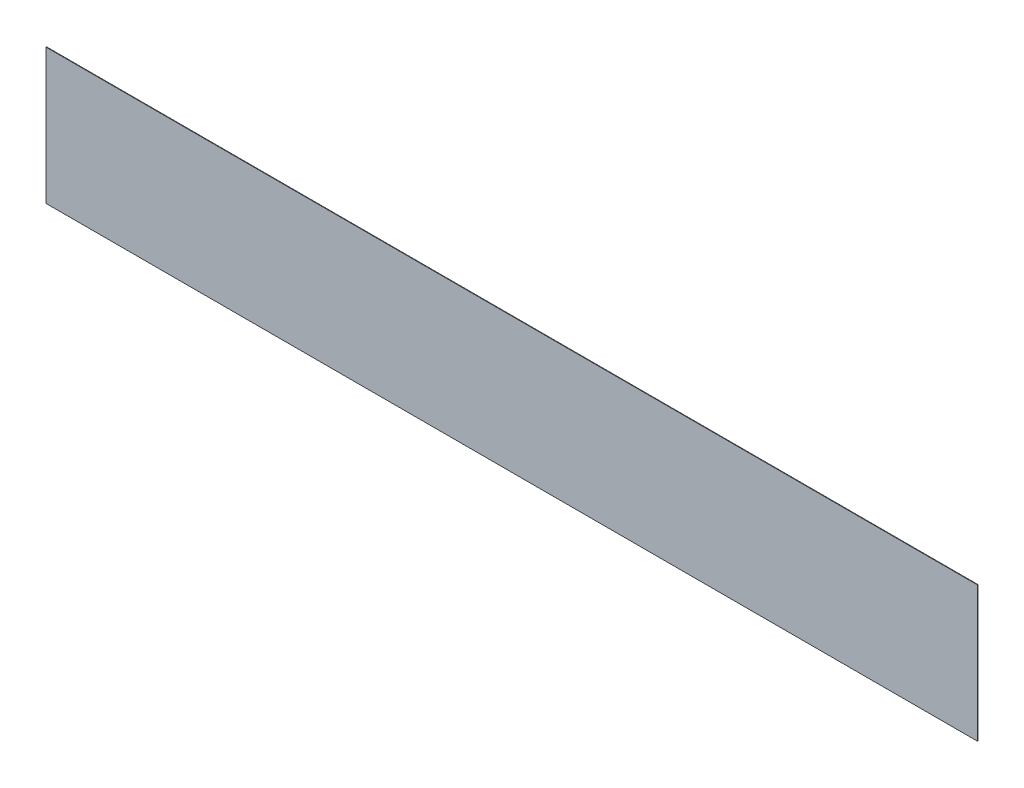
ISO-10303-21;
HEADER;
FILE_DESCRIPTION(('STEP AP214'),'2;1');
FILE_NAME('part.step','',(''),(''),'','','');
FILE_SCHEMA(('AUTOMOTIVE_DESIGN { 1 0 10303 214 1 1 1 1 }'));
ENDSEC;
DATA;
#1=APPLICATION_CONTEXT('core data for automotive mechanical design processes');
#2=APPLICATION_PROTOCOL_DEFINITION('international standard','automotive_design',2000,#1);
#3=PRODUCT_CONTEXT('',#1,'mechanical');
#4=PRODUCT('Part','Part','',(#3));
#5=PRODUCT_RELATED_PRODUCT_CATEGORY('part','',(#4));
#6=PRODUCT_DEFINITION_FORMATION('','',#4);
#7=PRODUCT_DEFINITION_CONTEXT('part definition',#1,'design');
#8=PRODUCT_DEFINITION('design','',#6,#7);
#9=PRODUCT_DEFINITION_SHAPE('','',#8);
#10=(LENGTH_UNIT() NAMED_UNIT(*) SI_UNIT(.MILLI.,.METRE.));
#11=(NAMED_UNIT(*) PLANE_ANGLE_UNIT() SI_UNIT($,.RADIAN.));
#12=(NAMED_UNIT(*) SI_UNIT($,.STERADIAN.) SOLID_ANGLE_UNIT());
#13=UNCERTAINTY_MEASURE_WITH_UNIT(LENGTH_MEASURE(1.E-05),#10,'distance_accuracy_value','');
#14=(GEOMETRIC_REPRESENTATION_CONTEXT(3) GLOBAL_UNCERTAINTY_ASSIGNED_CONTEXT((#13)) GLOBAL_UNIT_ASSIGNED_CONTEXT((#10,
#11,#12)) REPRESENTATION_CONTEXT('',''));
#15=CARTESIAN_POINT('',(0.,0.,0.));
#16=DIRECTION('',(0.,0.,1.));
#17=DIRECTION('',(1.,0.,0.));
#18=AXIS2_PLACEMENT_3D('',#15,#16,#17);
#19=CARTESIAN_POINT('',(7.,0.,0.1));
#20=DIRECTION('',(1.,0.,0.));
#21=DIRECTION('',(0.,0.,-1.));
#22=AXIS2_PLACEMENT_3D('',#19,#20,#21);
#23=PLANE('',#22);
#24=DIRECTION('',(0.,-1.,0.));
#25=VECTOR('',#24,1.);
#26=CARTESIAN_POINT('',(7.,0.,0.));
#27=LINE('',#26,#25);
#28=CARTESIAN_POINT('',(7.,25.,0.));
#29=VERTEX_POINT('',#28);
#30=CARTESIAN_POINT('',(7.,0.,0.));
#31=VERTEX_POINT('',#30);
#32=EDGE_CURVE('E98',#29,#31,#27,.T.);
#33=ORIENTED_EDGE('',*,*,#32,.T.);
#34=DIRECTION('',(0.,0.,-1.));
#35=VECTOR('',#34,1.);
#36=CARTESIAN_POINT('',(7.,0.,0.1));
#37=LINE('',#36,#35);
#38=CARTESIAN_POINT('',(7.,0.,0.1));
#39=VERTEX_POINT('',#38);
#40=EDGE_CURVE('E11',#39,#31,#37,.T.);
#41=ORIENTED_EDGE('',*,*,#40,.F.);
#42=DIRECTION('',(0.,-1.,0.));
#43=VECTOR('',#42,1.);
#44=CARTESIAN_POINT('',(7.,0.,0.1));
#45=LINE('',#44,#43);
#46=CARTESIAN_POINT('',(7.,25.,0.1));
#47=VERTEX_POINT('',#46);
#48=EDGE_CURVE('E86',#47,#39,#45,.T.);
#49=ORIENTED_EDGE('',*,*,#48,.F.);
#50=DIRECTION('',(0.,0.,-1.));
#51=VECTOR('',#50,1.);
#52=CARTESIAN_POINT('',(7.,25.,0.1));
#53=LINE('',#52,#51);
#54=EDGE_CURVE('E94',#47,#29,#53,.T.);
#55=ORIENTED_EDGE('',*,*,#54,.T.);
#56=EDGE_LOOP('',(#33,#41,#49,#55));
#57=FACE_BOUND('',#56,.T.);
#58=ADVANCED_FACE('F35',(#57),#23,.F.);
#59=CARTESIAN_POINT('',(7.,0.,0.1));
#60=DIRECTION('',(0.,1.,0.));
#61=DIRECTION('',(0.,0.,1.));
#62=AXIS2_PLACEMENT_3D('',#59,#60,#61);
#63=PLANE('',#62);
#64=DIRECTION('',(1.,0.,0.));
#65=VECTOR('',#64,1.);
#66=CARTESIAN_POINT('',(7.,0.,0.));
#67=LINE('',#66,#65);
#68=CARTESIAN_POINT('',(179.,0.,0.));
#69=VERTEX_POINT('',#68);
#70=EDGE_CURVE('E90',#31,#69,#67,.T.);
#71=ORIENTED_EDGE('',*,*,#70,.T.);
#72=DIRECTION('',(0.,0.,-1.));
#73=VECTOR('',#72,1.);
#74=CARTESIAN_POINT('',(179.,0.,0.1));
#75=LINE('',#74,#73);
#76=CARTESIAN_POINT('',(179.,0.,0.1));
#77=VERTEX_POINT('',#76);
#78=EDGE_CURVE('E43',#77,#69,#75,.T.);
#79=ORIENTED_EDGE('',*,*,#78,.F.);
#80=DIRECTION('',(1.,0.,0.));
#81=VECTOR('',#80,1.);
#82=CARTESIAN_POINT('',(7.,0.,0.1));
#83=LINE('',#82,#81);
#84=EDGE_CURVE('E81',#39,#77,#83,.T.);
#85=ORIENTED_EDGE('',*,*,#84,.F.);
#86=ORIENTED_EDGE('',*,*,#40,.T.);
#87=EDGE_LOOP('',(#71,#79,#85,#86));
#88=FACE_BOUND('',#87,.T.);
#89=ADVANCED_FACE('F89',(#88),#63,.F.);
#90=CARTESIAN_POINT('',(179.,0.,0.1));
#91=DIRECTION('',(-1.,0.,0.));
#92=DIRECTION('',(0.,0.,1.));
#93=AXIS2_PLACEMENT_3D('',#90,#91,#92);
#94=PLANE('',#93);
#95=DIRECTION('',(0.,1.,0.));
#96=VECTOR('',#95,1.);
#97=CARTESIAN_POINT('',(179.,0.,0.));
#98=LINE('',#97,#96);
#99=CARTESIAN_POINT('',(179.,25.,0.));
#100=VERTEX_POINT('',#99);
#101=EDGE_CURVE('E68',#69,#100,#98,.T.);
#102=ORIENTED_EDGE('',*,*,#101,.T.);
#103=DIRECTION('',(0.,0.,-1.));
#104=VECTOR('',#103,1.);
#105=CARTESIAN_POINT('',(179.,25.,0.1));
#106=LINE('',#105,#104);
#107=CARTESIAN_POINT('',(179.,25.,0.1));
#108=VERTEX_POINT('',#107);
#109=EDGE_CURVE('E91',#108,#100,#106,.T.);
#110=ORIENTED_EDGE('',*,*,#109,.F.);
#111=DIRECTION('',(0.,1.,0.));
#112=VECTOR('',#111,1.);
#113=CARTESIAN_POINT('',(179.,0.,0.1));
#114=LINE('',#113,#112);
#115=EDGE_CURVE('E84',#77,#108,#114,.T.);
#116=ORIENTED_EDGE('',*,*,#115,.F.);
#117=ORIENTED_EDGE('',*,*,#78,.T.);
#118=EDGE_LOOP('',(#102,#110,#116,#117));
#119=FACE_BOUND('',#118,.T.);
#120=ADVANCED_FACE('F92',(#119),#94,.F.);
#121=CARTESIAN_POINT('',(7.,25.,0.1));
#122=DIRECTION('',(0.,-1.,0.));
#123=DIRECTION('',(0.,0.,-1.));
#124=AXIS2_PLACEMENT_3D('',#121,#122,#123);
#125=PLANE('',#124);
#126=DIRECTION('',(-1.,0.,0.));
#127=VECTOR('',#126,1.);
#128=CARTESIAN_POINT('',(7.,25.,0.));
#129=LINE('',#128,#127);
#130=EDGE_CURVE('E74',#100,#29,#129,.T.);
#131=ORIENTED_EDGE('',*,*,#130,.T.);
#132=ORIENTED_EDGE('',*,*,#54,.F.);
#133=DIRECTION('',(-1.,0.,0.));
#134=VECTOR('',#133,1.);
#135=CARTESIAN_POINT('',(7.,25.,0.1));
#136=LINE('',#135,#134);
#137=EDGE_CURVE('E51',#108,#47,#136,.T.);
#138=ORIENTED_EDGE('',*,*,#137,.F.);
#139=ORIENTED_EDGE('',*,*,#109,.T.);
#140=EDGE_LOOP('',(#131,#132,#138,#139));
#141=FACE_BOUND('',#140,.T.);
#142=ADVANCED_FACE('F105',(#141),#125,.F.);
#143=CARTESIAN_POINT('',(0.,0.,0.1));
#144=DIRECTION('',(0.,0.,-1.));
#145=DIRECTION('',(-1.,0.,0.));
#146=AXIS2_PLACEMENT_3D('',#143,#144,#145);
#147=PLANE('',#146);
#148=ORIENTED_EDGE('',*,*,#48,.T.);
#149=ORIENTED_EDGE('',*,*,#84,.T.);
#150=ORIENTED_EDGE('',*,*,#115,.T.);
#151=ORIENTED_EDGE('',*,*,#137,.T.);
#152=EDGE_LOOP('',(#148,#149,#150,#151));
#153=FACE_BOUND('',#152,.T.);
#154=ADVANCED_FACE('F82',(#153),#147,.F.);
#155=CARTESIAN_POINT('',(0.,0.,0.));
#156=DIRECTION('',(0.,0.,-1.));
#157=DIRECTION('',(-1.,0.,0.));
#158=AXIS2_PLACEMENT_3D('',#155,#156,#157);
#159=PLANE('',#158);
#160=ORIENTED_EDGE('',*,*,#32,.F.);
#161=ORIENTED_EDGE('',*,*,#130,.F.);
#162=ORIENTED_EDGE('',*,*,#101,.F.);
#163=ORIENTED_EDGE('',*,*,#70,.F.);
#164=EDGE_LOOP('',(#160,#161,#162,#163));
#165=FACE_BOUND('',#164,.T.);
#166=ADVANCED_FACE('F108',(#165),#159,.T.);
#167=CLOSED_SHELL('',(#58,#89,#120,#142,#154,#166));
#168=MANIFOLD_SOLID_BREP('B2',#167);
#169=ADVANCED_BREP_SHAPE_REPRESENTATION('',(#18,#168),#14);
#170=SHAPE_DEFINITION_REPRESENTATION(#9,#169);
ENDSEC;
END-ISO-10303-21;
